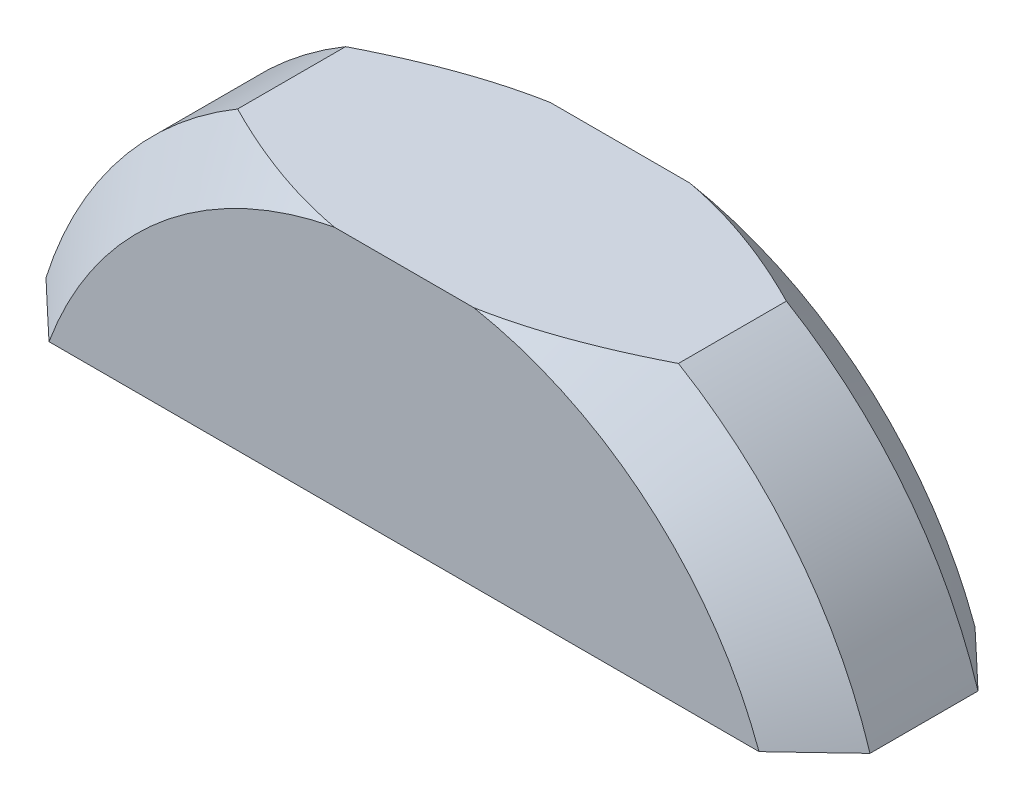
ISO-10303-21;
HEADER;
FILE_DESCRIPTION(('STEP AP214'),'2;1');
FILE_NAME('part.step','',(''),(''),'','','');
FILE_SCHEMA(('AUTOMOTIVE_DESIGN { 1 0 10303 214 1 1 1 1 }'));
ENDSEC;
DATA;
#1=APPLICATION_CONTEXT('core data for automotive mechanical design processes');
#2=APPLICATION_PROTOCOL_DEFINITION('international standard','automotive_design',2000,#1);
#3=PRODUCT_CONTEXT('',#1,'mechanical');
#4=PRODUCT('Part','Part','',(#3));
#5=PRODUCT_RELATED_PRODUCT_CATEGORY('part','',(#4));
#6=PRODUCT_DEFINITION_FORMATION('','',#4);
#7=PRODUCT_DEFINITION_CONTEXT('part definition',#1,'design');
#8=PRODUCT_DEFINITION('design','',#6,#7);
#9=PRODUCT_DEFINITION_SHAPE('','',#8);
#10=(LENGTH_UNIT() NAMED_UNIT(*) SI_UNIT(.MILLI.,.METRE.));
#11=(NAMED_UNIT(*) PLANE_ANGLE_UNIT() SI_UNIT($,.RADIAN.));
#12=(NAMED_UNIT(*) SI_UNIT($,.STERADIAN.) SOLID_ANGLE_UNIT());
#13=UNCERTAINTY_MEASURE_WITH_UNIT(LENGTH_MEASURE(1.E-05),#10,'distance_accuracy_value','');
#14=(GEOMETRIC_REPRESENTATION_CONTEXT(3) GLOBAL_UNCERTAINTY_ASSIGNED_CONTEXT((#13)) GLOBAL_UNIT_ASSIGNED_CONTEXT((#10,
#11,#12)) REPRESENTATION_CONTEXT('',''));
#15=CARTESIAN_POINT('',(0.,0.,0.));
#16=DIRECTION('',(0.,0.,1.));
#17=DIRECTION('',(1.,0.,0.));
#18=AXIS2_PLACEMENT_3D('',#15,#16,#17);
#19=CARTESIAN_POINT('',(0.,0.,1.));
#20=DIRECTION('',(0.,0.,-1.));
#21=DIRECTION('',(-1.,0.,0.));
#22=AXIS2_PLACEMENT_3D('',#19,#20,#21);
#23=CYLINDRICAL_SURFACE('',#22,2.);
#24=DIRECTION('',(0.,0.,-1.));
#25=VECTOR('',#24,1.);
#26=CARTESIAN_POINT('',(-1.02058806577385,1.72,1.));
#27=LINE('',#26,#25);
#28=CARTESIAN_POINT('',(-1.02058806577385,1.72,0.749999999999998));
#29=VERTEX_POINT('',#28);
#30=CARTESIAN_POINT('',(-1.02058806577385,1.72,0.250000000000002));
#31=VERTEX_POINT('',#30);
#32=EDGE_CURVE('E219',#29,#31,#27,.T.);
#33=ORIENTED_EDGE('',*,*,#32,.T.);
#34=CARTESIAN_POINT('',(0.,0.,0.250000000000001));
#35=DIRECTION('',(0.,0.,-1.));
#36=DIRECTION('',(-1.,0.,0.));
#37=AXIS2_PLACEMENT_3D('',#34,#35,#36);
#38=CIRCLE('',#37,2.);
#39=CARTESIAN_POINT('',(-1.90787840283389,0.6,0.25));
#40=VERTEX_POINT('',#39);
#41=EDGE_CURVE('E112',#31,#40,#38,.F.);
#42=ORIENTED_EDGE('',*,*,#41,.T.);
#43=DIRECTION('',(0.,0.,-1.));
#44=VECTOR('',#43,1.);
#45=CARTESIAN_POINT('',(-1.90787840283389,0.6,1.));
#46=LINE('',#45,#44);
#47=CARTESIAN_POINT('',(-1.90787840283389,0.6,0.749999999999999));
#48=VERTEX_POINT('',#47);
#49=EDGE_CURVE('E104',#48,#40,#46,.T.);
#50=ORIENTED_EDGE('',*,*,#49,.F.);
#51=CARTESIAN_POINT('',(0.,0.,0.749999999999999));
#52=DIRECTION('',(0.,0.,-1.));
#53=DIRECTION('',(-1.,0.,0.));
#54=AXIS2_PLACEMENT_3D('',#51,#52,#53);
#55=CIRCLE('',#54,2.);
#56=EDGE_CURVE('E117',#48,#29,#55,.T.);
#57=ORIENTED_EDGE('',*,*,#56,.T.);
#58=EDGE_LOOP('',(#33,#42,#50,#57));
#59=FACE_BOUND('',#58,.T.);
#60=ADVANCED_FACE('F33',(#59),#23,.T.);
#61=CARTESIAN_POINT('',(-1.90787840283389,0.6,1.));
#62=DIRECTION('',(0.,1.,0.));
#63=DIRECTION('',(0.,0.,1.));
#64=AXIS2_PLACEMENT_3D('',#61,#62,#63);
#65=PLANE('',#64);
#66=ORIENTED_EDGE('',*,*,#49,.T.);
#67=CARTESIAN_POINT('',(-1.90787840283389,0.6,0.250000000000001));
#68=CARTESIAN_POINT('',(-1.86404580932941,0.6,0.208165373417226));
#69=CARTESIAN_POINT('',(-1.82013366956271,0.6,0.166414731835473));
#70=CARTESIAN_POINT('',(-1.7321502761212,0.6,0.0830813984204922));
#71=CARTESIAN_POINT('',(-1.68807902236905,0.6,0.0414987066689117));
#72=CARTESIAN_POINT('',(-1.64392822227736,0.6,0.));
#73=B_SPLINE_CURVE_WITH_KNOTS('',3,(#67,#68,#69,#70,#71,#72),.UNSPECIFIED.,.F.,.F.,(4,2,4),(0.,
0.181776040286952,0.363552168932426),.UNSPECIFIED.);
#74=CARTESIAN_POINT('',(-1.64392822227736,0.6,0.));
#75=VERTEX_POINT('',#74);
#76=EDGE_CURVE('E152',#40,#75,#73,.T.);
#77=ORIENTED_EDGE('',*,*,#76,.T.);
#78=DIRECTION('',(1.,0.,0.));
#79=VECTOR('',#78,1.);
#80=CARTESIAN_POINT('',(-1.90787840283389,0.6,0.));
#81=LINE('',#80,#79);
#82=CARTESIAN_POINT('',(1.64392822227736,0.6,0.));
#83=VERTEX_POINT('',#82);
#84=EDGE_CURVE('E200',#75,#83,#81,.T.);
#85=ORIENTED_EDGE('',*,*,#84,.T.);
#86=CARTESIAN_POINT('',(1.64392822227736,0.6,0.));
#87=CARTESIAN_POINT('',(1.68807902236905,0.6,0.0414987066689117));
#88=CARTESIAN_POINT('',(1.7321502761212,0.6,0.0830813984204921));
#89=CARTESIAN_POINT('',(1.82013366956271,0.6,0.166414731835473));
#90=CARTESIAN_POINT('',(1.86404580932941,0.6,0.208165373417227));
#91=CARTESIAN_POINT('',(1.90787840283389,0.6,0.250000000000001));
#92=B_SPLINE_CURVE_WITH_KNOTS('',3,(#86,#87,#88,#89,#90,#91),.UNSPECIFIED.,.F.,.F.,(4,2,4),(0.,
0.181776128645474,0.363552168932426),.UNSPECIFIED.);
#93=CARTESIAN_POINT('',(1.90787840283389,0.6,0.25));
#94=VERTEX_POINT('',#93);
#95=EDGE_CURVE('E147',#83,#94,#92,.T.);
#96=ORIENTED_EDGE('',*,*,#95,.T.);
#97=DIRECTION('',(0.,0.,-1.));
#98=VECTOR('',#97,1.);
#99=CARTESIAN_POINT('',(1.90787840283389,0.6,1.));
#100=LINE('',#99,#98);
#101=CARTESIAN_POINT('',(1.90787840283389,0.6,0.750000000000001));
#102=VERTEX_POINT('',#101);
#103=EDGE_CURVE('E120',#102,#94,#100,.T.);
#104=ORIENTED_EDGE('',*,*,#103,.F.);
#105=CARTESIAN_POINT('',(1.90787840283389,0.6,0.75));
#106=CARTESIAN_POINT('',(1.86404580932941,0.6,0.791834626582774));
#107=CARTESIAN_POINT('',(1.82013366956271,0.6,0.833585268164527));
#108=CARTESIAN_POINT('',(1.7321502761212,0.6,0.916918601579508));
#109=CARTESIAN_POINT('',(1.68807902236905,0.6,0.958501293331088));
#110=CARTESIAN_POINT('',(1.64392822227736,0.6,1.));
#111=B_SPLINE_CURVE_WITH_KNOTS('',3,(#105,#106,#107,#108,#109,#110),.UNSPECIFIED.,.F.,.F.,(4,2,
4),(0.,0.181776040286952,0.363552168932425),.UNSPECIFIED.);
#112=CARTESIAN_POINT('',(1.64392822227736,0.6,1.));
#113=VERTEX_POINT('',#112);
#114=EDGE_CURVE('E111',#102,#113,#111,.T.);
#115=ORIENTED_EDGE('',*,*,#114,.T.);
#116=DIRECTION('',(1.,0.,0.));
#117=VECTOR('',#116,1.);
#118=CARTESIAN_POINT('',(-1.90787840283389,0.6,1.));
#119=LINE('',#118,#117);
#120=CARTESIAN_POINT('',(-1.64392822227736,0.6,1.));
#121=VERTEX_POINT('',#120);
#122=EDGE_CURVE('E106',#121,#113,#119,.T.);
#123=ORIENTED_EDGE('',*,*,#122,.F.);
#124=CARTESIAN_POINT('',(-1.64392822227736,0.6,1.));
#125=CARTESIAN_POINT('',(-1.68807902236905,0.6,0.958501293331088));
#126=CARTESIAN_POINT('',(-1.7321502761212,0.6,0.916918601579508));
#127=CARTESIAN_POINT('',(-1.82013366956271,0.6,0.833585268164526));
#128=CARTESIAN_POINT('',(-1.86404580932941,0.6,0.791834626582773));
#129=CARTESIAN_POINT('',(-1.90787840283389,0.6,0.749999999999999));
#130=B_SPLINE_CURVE_WITH_KNOTS('',3,(#124,#125,#126,#127,#128,#129),.UNSPECIFIED.,.F.,.F.,(4,2,
4),(0.,0.181776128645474,0.363552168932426),.UNSPECIFIED.);
#131=EDGE_CURVE('E101',#121,#48,#130,.T.);
#132=ORIENTED_EDGE('',*,*,#131,.T.);
#133=EDGE_LOOP('',(#66,#77,#85,#96,#104,#115,#123,#132));
#134=FACE_BOUND('',#133,.T.);
#135=ADVANCED_FACE('F103',(#134),#65,.F.);
#136=CARTESIAN_POINT('',(0.,0.,1.));
#137=DIRECTION('',(0.,0.,-1.));
#138=DIRECTION('',(-1.,0.,0.));
#139=AXIS2_PLACEMENT_3D('',#136,#137,#138);
#140=CYLINDRICAL_SURFACE('',#139,2.);
#141=ORIENTED_EDGE('',*,*,#103,.T.);
#142=CARTESIAN_POINT('',(0.,0.,0.250000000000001));
#143=DIRECTION('',(0.,0.,-1.));
#144=DIRECTION('',(-1.,0.,0.));
#145=AXIS2_PLACEMENT_3D('',#142,#143,#144);
#146=CIRCLE('',#145,2.);
#147=CARTESIAN_POINT('',(1.02058806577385,1.72,0.250000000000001));
#148=VERTEX_POINT('',#147);
#149=EDGE_CURVE('E209',#94,#148,#146,.F.);
#150=ORIENTED_EDGE('',*,*,#149,.T.);
#151=DIRECTION('',(0.,0.,-1.));
#152=VECTOR('',#151,1.);
#153=CARTESIAN_POINT('',(1.02058806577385,1.72,1.));
#154=LINE('',#153,#152);
#155=CARTESIAN_POINT('',(1.02058806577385,1.72,0.75));
#156=VERTEX_POINT('',#155);
#157=EDGE_CURVE('E221',#156,#148,#154,.T.);
#158=ORIENTED_EDGE('',*,*,#157,.F.);
#159=CARTESIAN_POINT('',(0.,0.,0.75));
#160=DIRECTION('',(0.,0.,-1.));
#161=DIRECTION('',(-1.,0.,0.));
#162=AXIS2_PLACEMENT_3D('',#159,#160,#161);
#163=CIRCLE('',#162,2.);
#164=EDGE_CURVE('E208',#156,#102,#163,.T.);
#165=ORIENTED_EDGE('',*,*,#164,.T.);
#166=EDGE_LOOP('',(#141,#150,#158,#165));
#167=FACE_BOUND('',#166,.T.);
#168=ADVANCED_FACE('F140',(#167),#140,.T.);
#169=CARTESIAN_POINT('',(-1.02058806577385,1.72,1.));
#170=DIRECTION('',(0.,-1.,0.));
#171=DIRECTION('',(0.,0.,-1.));
#172=AXIS2_PLACEMENT_3D('',#169,#170,#171);
#173=PLANE('',#172);
#174=DIRECTION('',(-1.,0.,0.));
#175=VECTOR('',#174,1.);
#176=CARTESIAN_POINT('',(-1.02058806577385,1.72,0.));
#177=LINE('',#176,#175);
#178=CARTESIAN_POINT('',(0.32264531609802,1.72,0.));
#179=VERTEX_POINT('',#178);
#180=CARTESIAN_POINT('',(-0.322645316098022,1.72,0.));
#181=VERTEX_POINT('',#180);
#182=EDGE_CURVE('E205',#179,#181,#177,.T.);
#183=ORIENTED_EDGE('',*,*,#182,.T.);
#184=CARTESIAN_POINT('',(-0.322645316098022,1.72,0.));
#185=CARTESIAN_POINT('',(-0.383861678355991,1.72,0.0112689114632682));
#186=CARTESIAN_POINT('',(-0.444440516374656,1.72,0.0255593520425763));
#187=CARTESIAN_POINT('',(-0.563859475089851,1.72,0.0591677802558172));
#188=CARTESIAN_POINT('',(-0.622707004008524,1.72,0.0784592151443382));
#189=CARTESIAN_POINT('',(-0.738772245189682,1.72,0.121165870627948));
#190=CARTESIAN_POINT('',(-0.795991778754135,1.72,0.144576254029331));
#191=CARTESIAN_POINT('',(-0.909245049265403,1.72,0.194881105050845));
#192=CARTESIAN_POINT('',(-0.965271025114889,1.72,0.221793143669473));
#193=CARTESIAN_POINT('',(-1.02058806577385,1.72,0.250000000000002));
#194=B_SPLINE_CURVE_WITH_KNOTS('',3,(#184,#185,#186,#187,#188,#189,#190,#191,#192,#193),
.UNSPECIFIED.,.F.,.F.,(4,2,2,2,4),(0.,0.18654466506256,0.372118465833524,0.557475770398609,
0.743801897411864),.UNSPECIFIED.);
#195=EDGE_CURVE('E171',#181,#31,#194,.T.);
#196=ORIENTED_EDGE('',*,*,#195,.T.);
#197=ORIENTED_EDGE('',*,*,#32,.F.);
#198=CARTESIAN_POINT('',(-1.02058806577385,1.72,0.749999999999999));
#199=CARTESIAN_POINT('',(-0.965271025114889,1.72,0.778206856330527));
#200=CARTESIAN_POINT('',(-0.909245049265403,1.72,0.805118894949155));
#201=CARTESIAN_POINT('',(-0.795991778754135,1.72,0.855423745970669));
#202=CARTESIAN_POINT('',(-0.738772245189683,1.72,0.878834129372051));
#203=CARTESIAN_POINT('',(-0.622707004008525,1.72,0.921540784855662));
#204=CARTESIAN_POINT('',(-0.563859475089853,1.72,0.940832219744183));
#205=CARTESIAN_POINT('',(-0.444440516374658,1.72,0.974440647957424));
#206=CARTESIAN_POINT('',(-0.383861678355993,1.72,0.988731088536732));
#207=CARTESIAN_POINT('',(-0.322645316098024,1.72,1.));
#208=B_SPLINE_CURVE_WITH_KNOTS('',3,(#198,#199,#200,#201,#202,#203,#204,#205,#206,#207),
.UNSPECIFIED.,.F.,.F.,(4,2,2,2,4),(0.,0.186326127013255,0.371683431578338,0.557257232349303,
0.743801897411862),.UNSPECIFIED.);
#209=CARTESIAN_POINT('',(-0.322645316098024,1.72,1.));
#210=VERTEX_POINT('',#209);
#211=EDGE_CURVE('E123',#29,#210,#208,.T.);
#212=ORIENTED_EDGE('',*,*,#211,.T.);
#213=DIRECTION('',(-1.,0.,0.));
#214=VECTOR('',#213,1.);
#215=CARTESIAN_POINT('',(-1.02058806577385,1.72,1.));
#216=LINE('',#215,#214);
#217=CARTESIAN_POINT('',(0.322645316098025,1.72,1.));
#218=VERTEX_POINT('',#217);
#219=EDGE_CURVE('E218',#218,#210,#216,.T.);
#220=ORIENTED_EDGE('',*,*,#219,.F.);
#221=CARTESIAN_POINT('',(0.322645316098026,1.72,1.));
#222=CARTESIAN_POINT('',(0.383861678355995,1.72,0.988731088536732));
#223=CARTESIAN_POINT('',(0.44444051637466,1.72,0.974440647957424));
#224=CARTESIAN_POINT('',(0.563859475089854,1.72,0.940832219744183));
#225=CARTESIAN_POINT('',(0.622707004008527,1.72,0.921540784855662));
#226=CARTESIAN_POINT('',(0.738772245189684,1.72,0.878834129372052));
#227=CARTESIAN_POINT('',(0.795991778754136,1.72,0.855423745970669));
#228=CARTESIAN_POINT('',(0.909245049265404,1.72,0.805118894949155));
#229=CARTESIAN_POINT('',(0.965271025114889,1.72,0.778206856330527));
#230=CARTESIAN_POINT('',(1.02058806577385,1.72,0.749999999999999));
#231=B_SPLINE_CURVE_WITH_KNOTS('',3,(#221,#222,#223,#224,#225,#226,#227,#228,#229,#230),
.UNSPECIFIED.,.F.,.F.,(4,2,2,2,4),(0.,0.186544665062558,0.372118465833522,0.557475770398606,
0.74380189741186),.UNSPECIFIED.);
#232=EDGE_CURVE('E57',#218,#156,#231,.T.);
#233=ORIENTED_EDGE('',*,*,#232,.T.);
#234=ORIENTED_EDGE('',*,*,#157,.T.);
#235=CARTESIAN_POINT('',(1.02058806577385,1.72,0.250000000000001));
#236=CARTESIAN_POINT('',(0.965271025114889,1.72,0.221793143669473));
#237=CARTESIAN_POINT('',(0.909245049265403,1.72,0.194881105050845));
#238=CARTESIAN_POINT('',(0.795991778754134,1.72,0.144576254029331));
#239=CARTESIAN_POINT('',(0.738772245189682,1.72,0.121165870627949));
#240=CARTESIAN_POINT('',(0.622707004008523,1.72,0.0784592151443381));
#241=CARTESIAN_POINT('',(0.563859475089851,1.72,0.0591677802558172));
#242=CARTESIAN_POINT('',(0.444440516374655,1.72,0.0255593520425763));
#243=CARTESIAN_POINT('',(0.38386167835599,1.72,0.0112689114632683));
#244=CARTESIAN_POINT('',(0.322645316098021,1.72,0.));
#245=B_SPLINE_CURVE_WITH_KNOTS('',3,(#235,#236,#237,#238,#239,#240,#241,#242,#243,#244),
.UNSPECIFIED.,.F.,.F.,(4,2,2,2,4),(0.,0.186326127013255,0.37168343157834,0.557257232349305,
0.743801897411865),.UNSPECIFIED.);
#246=EDGE_CURVE('E49',#148,#179,#245,.T.);
#247=ORIENTED_EDGE('',*,*,#246,.T.);
#248=EDGE_LOOP('',(#183,#196,#197,#212,#220,#233,#234,#247));
#249=FACE_BOUND('',#248,.T.);
#250=ADVANCED_FACE('F180',(#249),#173,.F.);
#251=CARTESIAN_POINT('',(0.,0.,1.));
#252=DIRECTION('',(0.,0.,-1.));
#253=DIRECTION('',(-1.,0.,0.));
#254=AXIS2_PLACEMENT_3D('',#251,#252,#253);
#255=PLANE('',#254);
#256=ORIENTED_EDGE('',*,*,#122,.T.);
#257=CARTESIAN_POINT('',(0.,0.,1.));
#258=DIRECTION('',(0.,0.,-1.));
#259=DIRECTION('',(-1.,0.,0.));
#260=AXIS2_PLACEMENT_3D('',#257,#258,#259);
#261=CIRCLE('',#260,1.75);
#262=EDGE_CURVE('E11',#113,#218,#261,.F.);
#263=ORIENTED_EDGE('',*,*,#262,.T.);
#264=ORIENTED_EDGE('',*,*,#219,.T.);
#265=CARTESIAN_POINT('',(0.,0.,1.));
#266=DIRECTION('',(0.,0.,-1.));
#267=DIRECTION('',(-1.,0.,0.));
#268=AXIS2_PLACEMENT_3D('',#265,#266,#267);
#269=CIRCLE('',#268,1.75);
#270=EDGE_CURVE('E42',#210,#121,#269,.F.);
#271=ORIENTED_EDGE('',*,*,#270,.T.);
#272=EDGE_LOOP('',(#256,#263,#264,#271));
#273=FACE_BOUND('',#272,.T.);
#274=ADVANCED_FACE('F184',(#273),#255,.F.);
#275=CARTESIAN_POINT('',(0.,0.,0.));
#276=DIRECTION('',(0.,0.,-1.));
#277=DIRECTION('',(-1.,0.,0.));
#278=AXIS2_PLACEMENT_3D('',#275,#276,#277);
#279=PLANE('',#278);
#280=ORIENTED_EDGE('',*,*,#84,.F.);
#281=CARTESIAN_POINT('',(0.,0.,0.));
#282=DIRECTION('',(0.,0.,-1.));
#283=DIRECTION('',(-1.,0.,0.));
#284=AXIS2_PLACEMENT_3D('',#281,#282,#283);
#285=CIRCLE('',#284,1.75);
#286=EDGE_CURVE('E194',#75,#181,#285,.T.);
#287=ORIENTED_EDGE('',*,*,#286,.T.);
#288=ORIENTED_EDGE('',*,*,#182,.F.);
#289=CARTESIAN_POINT('',(0.,0.,0.));
#290=DIRECTION('',(0.,0.,-1.));
#291=DIRECTION('',(-1.,0.,0.));
#292=AXIS2_PLACEMENT_3D('',#289,#290,#291);
#293=CIRCLE('',#292,1.75);
#294=EDGE_CURVE('E195',#179,#83,#293,.T.);
#295=ORIENTED_EDGE('',*,*,#294,.T.);
#296=EDGE_LOOP('',(#280,#287,#288,#295));
#297=FACE_BOUND('',#296,.T.);
#298=ADVANCED_FACE('F185',(#297),#279,.T.);
#299=CARTESIAN_POINT('',(0.,0.,0.250000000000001));
#300=DIRECTION('',(0.,0.,1.));
#301=DIRECTION('',(1.,0.,0.));
#302=AXIS2_PLACEMENT_3D('',#299,#300,#301);
#303=CONICAL_SURFACE('',#302,2.,0.785398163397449);
#304=ORIENTED_EDGE('',*,*,#195,.F.);
#305=ORIENTED_EDGE('',*,*,#286,.F.);
#306=ORIENTED_EDGE('',*,*,#76,.F.);
#307=ORIENTED_EDGE('',*,*,#41,.F.);
#308=EDGE_LOOP('',(#304,#305,#306,#307));
#309=FACE_BOUND('',#308,.T.);
#310=ADVANCED_FACE('F161',(#309),#303,.T.);
#311=CARTESIAN_POINT('',(0.,0.,0.250000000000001));
#312=DIRECTION('',(0.,0.,1.));
#313=DIRECTION('',(1.,0.,0.));
#314=AXIS2_PLACEMENT_3D('',#311,#312,#313);
#315=CONICAL_SURFACE('',#314,2.,0.785398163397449);
#316=ORIENTED_EDGE('',*,*,#95,.F.);
#317=ORIENTED_EDGE('',*,*,#294,.F.);
#318=ORIENTED_EDGE('',*,*,#246,.F.);
#319=ORIENTED_EDGE('',*,*,#149,.F.);
#320=EDGE_LOOP('',(#316,#317,#318,#319));
#321=FACE_BOUND('',#320,.T.);
#322=ADVANCED_FACE('F157',(#321),#315,.T.);
#323=CARTESIAN_POINT('',(0.,0.,1.));
#324=DIRECTION('',(0.,0.,-1.));
#325=DIRECTION('',(-1.,0.,0.));
#326=AXIS2_PLACEMENT_3D('',#323,#324,#325);
#327=CONICAL_SURFACE('',#326,1.75,0.785398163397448);
#328=ORIENTED_EDGE('',*,*,#114,.F.);
#329=ORIENTED_EDGE('',*,*,#164,.F.);
#330=ORIENTED_EDGE('',*,*,#232,.F.);
#331=ORIENTED_EDGE('',*,*,#262,.F.);
#332=EDGE_LOOP('',(#328,#329,#330,#331));
#333=FACE_BOUND('',#332,.T.);
#334=ADVANCED_FACE('F160',(#333),#327,.T.);
#335=CARTESIAN_POINT('',(0.,0.,1.));
#336=DIRECTION('',(0.,0.,-1.));
#337=DIRECTION('',(-1.,0.,0.));
#338=AXIS2_PLACEMENT_3D('',#335,#336,#337);
#339=CONICAL_SURFACE('',#338,1.75,0.785398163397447);
#340=ORIENTED_EDGE('',*,*,#211,.F.);
#341=ORIENTED_EDGE('',*,*,#56,.F.);
#342=ORIENTED_EDGE('',*,*,#131,.F.);
#343=ORIENTED_EDGE('',*,*,#270,.F.);
#344=EDGE_LOOP('',(#340,#341,#342,#343));
#345=FACE_BOUND('',#344,.T.);
#346=ADVANCED_FACE('F35',(#345),#339,.T.);
#347=CLOSED_SHELL('',(#60,#135,#168,#250,#274,#298,#310,#322,#334,#346));
#348=MANIFOLD_SOLID_BREP('B2',#347);
#349=ADVANCED_BREP_SHAPE_REPRESENTATION('',(#18,#348),#14);
#350=SHAPE_DEFINITION_REPRESENTATION(#9,#349);
ENDSEC;
END-ISO-10303-21;
